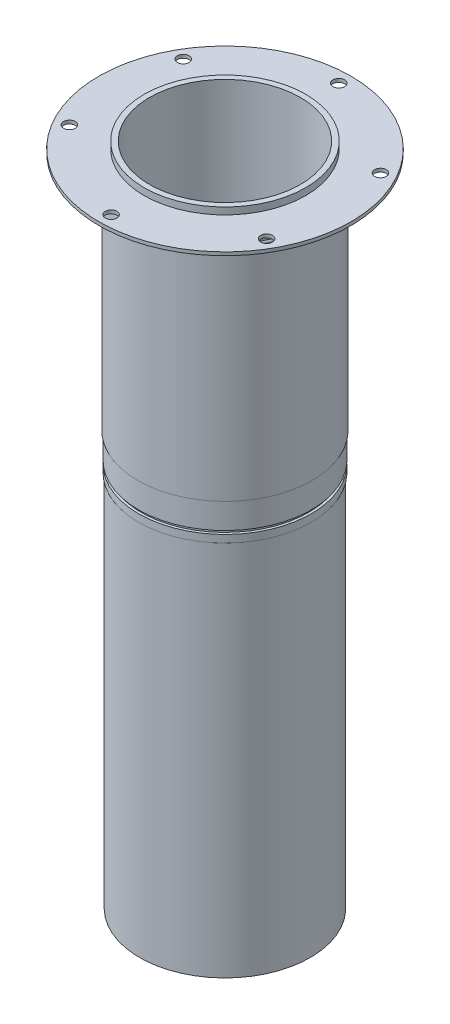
ISO-10303-21;
HEADER;
FILE_DESCRIPTION(('STEP AP214'),'2;1');
FILE_NAME('part.step','',(''),(''),'','','');
FILE_SCHEMA(('AUTOMOTIVE_DESIGN { 1 0 10303 214 1 1 1 1 }'));
ENDSEC;
DATA;
#1=APPLICATION_CONTEXT('core data for automotive mechanical design processes');
#2=APPLICATION_PROTOCOL_DEFINITION('international standard','automotive_design',2000,#1);
#3=PRODUCT_CONTEXT('',#1,'mechanical');
#4=PRODUCT('Part','Part','',(#3));
#5=PRODUCT_RELATED_PRODUCT_CATEGORY('part','',(#4));
#6=PRODUCT_DEFINITION_FORMATION('','',#4);
#7=PRODUCT_DEFINITION_CONTEXT('part definition',#1,'design');
#8=PRODUCT_DEFINITION('design','',#6,#7);
#9=PRODUCT_DEFINITION_SHAPE('','',#8);
#10=(LENGTH_UNIT() NAMED_UNIT(*) SI_UNIT(.MILLI.,.METRE.));
#11=(NAMED_UNIT(*) PLANE_ANGLE_UNIT() SI_UNIT($,.RADIAN.));
#12=(NAMED_UNIT(*) SI_UNIT($,.STERADIAN.) SOLID_ANGLE_UNIT());
#13=UNCERTAINTY_MEASURE_WITH_UNIT(LENGTH_MEASURE(1.E-05),#10,'distance_accuracy_value','');
#14=(GEOMETRIC_REPRESENTATION_CONTEXT(3) GLOBAL_UNCERTAINTY_ASSIGNED_CONTEXT((#13)) GLOBAL_UNIT_ASSIGNED_CONTEXT((#10,
#11,#12)) REPRESENTATION_CONTEXT('',''));
#15=CARTESIAN_POINT('',(0.,0.,0.));
#16=DIRECTION('',(0.,0.,1.));
#17=DIRECTION('',(1.,0.,0.));
#18=AXIS2_PLACEMENT_3D('',#15,#16,#17);
#19=CARTESIAN_POINT('',(-23.8125,0.,0.));
#20=DIRECTION('',(0.,-1.,0.));
#21=DIRECTION('',(0.,0.,-1.));
#22=AXIS2_PLACEMENT_3D('',#19,#20,#21);
#23=PLANE('',#22);
#24=CARTESIAN_POINT('',(0.,0.,0.));
#25=DIRECTION('',(0.,-1.,0.));
#26=DIRECTION('',(0.,0.,-1.));
#27=AXIS2_PLACEMENT_3D('',#24,#25,#26);
#28=CIRCLE('',#27,23.8125);
#29=CARTESIAN_POINT('',(0.,0.,-23.8125));
#30=VERTEX_POINT('',#29);
#31=EDGE_CURVE('E111',#30,#30,#28,.T.);
#32=ORIENTED_EDGE('',*,*,#31,.T.);
#33=EDGE_LOOP('',(#32));
#34=FACE_BOUND('',#33,.T.);
#35=CARTESIAN_POINT('',(0.,0.,0.));
#36=DIRECTION('',(0.,-1.,0.));
#37=DIRECTION('',(0.,0.,-1.));
#38=AXIS2_PLACEMENT_3D('',#35,#36,#37);
#39=CIRCLE('',#38,37.1348);
#40=CARTESIAN_POINT('',(0.,0.,-37.1348));
#41=VERTEX_POINT('',#40);
#42=EDGE_CURVE('E115',#41,#41,#39,.T.);
#43=ORIENTED_EDGE('',*,*,#42,.F.);
#44=EDGE_LOOP('',(#43));
#45=FACE_BOUND('',#44,.T.);
#46=CARTESIAN_POINT('',(29.0360997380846,0.,16.7640000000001));
#47=DIRECTION('',(0.,1.,0.));
#48=DIRECTION('',(0.,0.,1.));
#49=AXIS2_PLACEMENT_3D('',#46,#47,#48);
#50=CIRCLE('',#49,1.7272);
#51=CARTESIAN_POINT('',(29.0360997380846,0.,18.4912000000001));
#52=VERTEX_POINT('',#51);
#53=EDGE_CURVE('E122',#52,#52,#50,.T.);
#54=ORIENTED_EDGE('',*,*,#53,.F.);
#55=EDGE_LOOP('',(#54));
#56=FACE_BOUND('',#55,.T.);
#57=CARTESIAN_POINT('',(-2.34187669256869E-13,0.,33.528));
#58=DIRECTION('',(0.,1.,0.));
#59=DIRECTION('',(0.,0.,1.));
#60=AXIS2_PLACEMENT_3D('',#57,#58,#59);
#61=CIRCLE('',#60,1.7272);
#62=CARTESIAN_POINT('',(-2.34187669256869E-13,0.,35.2552));
#63=VERTEX_POINT('',#62);
#64=EDGE_CURVE('E129',#63,#63,#61,.T.);
#65=ORIENTED_EDGE('',*,*,#64,.F.);
#66=EDGE_LOOP('',(#65));
#67=FACE_BOUND('',#66,.T.);
#68=CARTESIAN_POINT('',(-29.0360997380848,0.,16.7639999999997));
#69=DIRECTION('',(0.,1.,0.));
#70=DIRECTION('',(0.,0.,1.));
#71=AXIS2_PLACEMENT_3D('',#68,#69,#70);
#72=CIRCLE('',#71,1.7272);
#73=CARTESIAN_POINT('',(-29.0360997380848,0.,18.4911999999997));
#74=VERTEX_POINT('',#73);
#75=EDGE_CURVE('E135',#74,#74,#72,.T.);
#76=ORIENTED_EDGE('',*,*,#75,.F.);
#77=EDGE_LOOP('',(#76));
#78=FACE_BOUND('',#77,.T.);
#79=CARTESIAN_POINT('',(-29.0360997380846,0.,-16.7640000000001));
#80=DIRECTION('',(0.,1.,0.));
#81=DIRECTION('',(0.,0.,1.));
#82=AXIS2_PLACEMENT_3D('',#79,#80,#81);
#83=CIRCLE('',#82,1.7272);
#84=CARTESIAN_POINT('',(-29.0360997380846,0.,-15.0368000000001));
#85=VERTEX_POINT('',#84);
#86=EDGE_CURVE('E142',#85,#85,#83,.T.);
#87=ORIENTED_EDGE('',*,*,#86,.F.);
#88=EDGE_LOOP('',(#87));
#89=FACE_BOUND('',#88,.T.);
#90=CARTESIAN_POINT('',(4.70110061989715E-13,0.,-33.528));
#91=DIRECTION('',(0.,1.,0.));
#92=DIRECTION('',(0.,0.,1.));
#93=AXIS2_PLACEMENT_3D('',#90,#91,#92);
#94=CIRCLE('',#93,1.7272);
#95=CARTESIAN_POINT('',(4.70110061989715E-13,0.,-31.8008));
#96=VERTEX_POINT('',#95);
#97=EDGE_CURVE('E150',#96,#96,#94,.T.);
#98=ORIENTED_EDGE('',*,*,#97,.F.);
#99=EDGE_LOOP('',(#98));
#100=FACE_BOUND('',#99,.T.);
#101=CARTESIAN_POINT('',(29.0360997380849,0.,-16.7639999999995));
#102=DIRECTION('',(0.,1.,0.));
#103=DIRECTION('',(0.,0.,1.));
#104=AXIS2_PLACEMENT_3D('',#101,#102,#103);
#105=CIRCLE('',#104,1.7272);
#106=CARTESIAN_POINT('',(29.0360997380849,0.,-15.0367999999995));
#107=VERTEX_POINT('',#106);
#108=EDGE_CURVE('E157',#107,#107,#105,.T.);
#109=ORIENTED_EDGE('',*,*,#108,.F.);
#110=EDGE_LOOP('',(#109));
#111=FACE_BOUND('',#110,.T.);
#112=ADVANCED_FACE('F37',(#34,#45,#56,#67,#78,#89,#100,#111),#23,.F.);
#113=CARTESIAN_POINT('',(0.,0.,0.));
#114=DIRECTION('',(0.,-1.,0.));
#115=DIRECTION('',(0.,0.,-1.));
#116=AXIS2_PLACEMENT_3D('',#113,#114,#115);
#117=CYLINDRICAL_SURFACE('',#116,37.1348);
#118=CARTESIAN_POINT('',(0.,-0.990600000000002,0.));
#119=DIRECTION('',(0.,-1.,0.));
#120=DIRECTION('',(0.,0.,-1.));
#121=AXIS2_PLACEMENT_3D('',#118,#119,#120);
#122=CIRCLE('',#121,37.1348);
#123=CARTESIAN_POINT('',(0.,-0.990600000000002,-37.1348));
#124=VERTEX_POINT('',#123);
#125=EDGE_CURVE('E45',#124,#124,#122,.T.);
#126=ORIENTED_EDGE('',*,*,#125,.F.);
#127=EDGE_LOOP('',(#126));
#128=FACE_BOUND('',#127,.T.);
#129=ORIENTED_EDGE('',*,*,#42,.T.);
#130=EDGE_LOOP('',(#129));
#131=FACE_BOUND('',#130,.T.);
#132=ADVANCED_FACE('F166',(#128,#131),#117,.T.);
#133=CARTESIAN_POINT('',(-37.1348,-0.990600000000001,0.));
#134=DIRECTION('',(0.,1.,0.));
#135=DIRECTION('',(0.,0.,1.));
#136=AXIS2_PLACEMENT_3D('',#133,#134,#135);
#137=PLANE('',#136);
#138=CARTESIAN_POINT('',(29.0360997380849,-0.990600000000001,-16.7639999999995));
#139=DIRECTION('',(0.,1.,0.));
#140=DIRECTION('',(0.,0.,1.));
#141=AXIS2_PLACEMENT_3D('',#138,#139,#140);
#142=CIRCLE('',#141,1.7272);
#143=CARTESIAN_POINT('',(29.0360997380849,-0.990600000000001,-15.0367999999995));
#144=VERTEX_POINT('',#143);
#145=EDGE_CURVE('E153',#144,#144,#142,.T.);
#146=ORIENTED_EDGE('',*,*,#145,.T.);
#147=EDGE_LOOP('',(#146));
#148=FACE_BOUND('',#147,.T.);
#149=CARTESIAN_POINT('',(4.70110061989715E-13,-0.990600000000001,-33.528));
#150=DIRECTION('',(0.,1.,0.));
#151=DIRECTION('',(0.,0.,1.));
#152=AXIS2_PLACEMENT_3D('',#149,#150,#151);
#153=CIRCLE('',#152,1.7272);
#154=CARTESIAN_POINT('',(4.70110061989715E-13,-0.990600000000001,-31.8008));
#155=VERTEX_POINT('',#154);
#156=EDGE_CURVE('E146',#155,#155,#153,.T.);
#157=ORIENTED_EDGE('',*,*,#156,.T.);
#158=EDGE_LOOP('',(#157));
#159=FACE_BOUND('',#158,.T.);
#160=CARTESIAN_POINT('',(-29.0360997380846,-0.990600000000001,-16.7640000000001));
#161=DIRECTION('',(0.,1.,0.));
#162=DIRECTION('',(0.,0.,1.));
#163=AXIS2_PLACEMENT_3D('',#160,#161,#162);
#164=CIRCLE('',#163,1.7272);
#165=CARTESIAN_POINT('',(-29.0360997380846,-0.990600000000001,-15.0368000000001));
#166=VERTEX_POINT('',#165);
#167=EDGE_CURVE('E138',#166,#166,#164,.T.);
#168=ORIENTED_EDGE('',*,*,#167,.T.);
#169=EDGE_LOOP('',(#168));
#170=FACE_BOUND('',#169,.T.);
#171=CARTESIAN_POINT('',(-29.0360997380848,-0.990600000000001,16.7639999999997));
#172=DIRECTION('',(0.,1.,0.));
#173=DIRECTION('',(0.,0.,1.));
#174=AXIS2_PLACEMENT_3D('',#171,#172,#173);
#175=CIRCLE('',#174,1.7272);
#176=CARTESIAN_POINT('',(-29.0360997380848,-0.990600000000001,18.4911999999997));
#177=VERTEX_POINT('',#176);
#178=EDGE_CURVE('E132',#177,#177,#175,.T.);
#179=ORIENTED_EDGE('',*,*,#178,.T.);
#180=EDGE_LOOP('',(#179));
#181=FACE_BOUND('',#180,.T.);
#182=CARTESIAN_POINT('',(-2.34187669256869E-13,-0.990600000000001,33.528));
#183=DIRECTION('',(0.,1.,0.));
#184=DIRECTION('',(0.,0.,1.));
#185=AXIS2_PLACEMENT_3D('',#182,#183,#184);
#186=CIRCLE('',#185,1.7272);
#187=CARTESIAN_POINT('',(-2.34187669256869E-13,-0.990600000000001,35.2552));
#188=VERTEX_POINT('',#187);
#189=EDGE_CURVE('E126',#188,#188,#186,.T.);
#190=ORIENTED_EDGE('',*,*,#189,.T.);
#191=EDGE_LOOP('',(#190));
#192=FACE_BOUND('',#191,.T.);
#193=CARTESIAN_POINT('',(29.0360997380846,-0.990600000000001,16.7640000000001));
#194=DIRECTION('',(0.,1.,0.));
#195=DIRECTION('',(0.,0.,1.));
#196=AXIS2_PLACEMENT_3D('',#193,#194,#195);
#197=CIRCLE('',#196,1.7272);
#198=CARTESIAN_POINT('',(29.0360997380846,-0.990600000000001,18.4912000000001));
#199=VERTEX_POINT('',#198);
#200=EDGE_CURVE('E118',#199,#199,#197,.T.);
#201=ORIENTED_EDGE('',*,*,#200,.T.);
#202=EDGE_LOOP('',(#201));
#203=FACE_BOUND('',#202,.T.);
#204=CARTESIAN_POINT('',(0.,-0.9906,0.));
#205=DIRECTION('',(0.,-1.,0.));
#206=DIRECTION('',(0.,0.,-1.));
#207=AXIS2_PLACEMENT_3D('',#204,#205,#206);
#208=CIRCLE('',#207,25.4);
#209=CARTESIAN_POINT('',(0.,-0.9906,-25.4));
#210=VERTEX_POINT('',#209);
#211=EDGE_CURVE('E52',#210,#210,#208,.T.);
#212=ORIENTED_EDGE('',*,*,#211,.F.);
#213=EDGE_LOOP('',(#212));
#214=FACE_BOUND('',#213,.T.);
#215=ORIENTED_EDGE('',*,*,#125,.T.);
#216=EDGE_LOOP('',(#215));
#217=FACE_BOUND('',#216,.T.);
#218=ADVANCED_FACE('F172',(#148,#159,#170,#181,#192,#203,#214,#217),#137,.F.);
#219=CARTESIAN_POINT('',(0.,0.,0.));
#220=DIRECTION('',(0.,-1.,0.));
#221=DIRECTION('',(0.,0.,-1.));
#222=AXIS2_PLACEMENT_3D('',#219,#220,#221);
#223=CYLINDRICAL_SURFACE('',#222,25.4);
#224=CARTESIAN_POINT('',(0.,-6.35,0.));
#225=DIRECTION('',(0.,-1.,0.));
#226=DIRECTION('',(0.,0.,-1.));
#227=AXIS2_PLACEMENT_3D('',#224,#225,#226);
#228=CIRCLE('',#227,25.4);
#229=CARTESIAN_POINT('',(0.,-6.35,-25.4));
#230=VERTEX_POINT('',#229);
#231=EDGE_CURVE('E59',#230,#230,#228,.T.);
#232=ORIENTED_EDGE('',*,*,#231,.F.);
#233=EDGE_LOOP('',(#232));
#234=FACE_BOUND('',#233,.T.);
#235=ORIENTED_EDGE('',*,*,#211,.T.);
#236=EDGE_LOOP('',(#235));
#237=FACE_BOUND('',#236,.T.);
#238=ADVANCED_FACE('F230',(#234,#237),#223,.T.);
#239=CARTESIAN_POINT('',(0.,0.,0.));
#240=DIRECTION('',(0.,-1.,0.));
#241=DIRECTION('',(0.,0.,-1.));
#242=AXIS2_PLACEMENT_3D('',#239,#240,#241);
#243=CYLINDRICAL_SURFACE('',#242,25.654);
#244=CARTESIAN_POINT('',(0.,-6.91796126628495,0.));
#245=DIRECTION('',(0.,1.,0.));
#246=DIRECTION('',(0.,0.,1.));
#247=AXIS2_PLACEMENT_3D('',#244,#245,#246);
#248=CIRCLE('',#247,25.654);
#249=CARTESIAN_POINT('',(0.,-6.91796126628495,25.654));
#250=VERTEX_POINT('',#249);
#251=EDGE_CURVE('E10',#250,#250,#248,.F.);
#252=ORIENTED_EDGE('',*,*,#251,.T.);
#253=EDGE_LOOP('',(#252));
#254=FACE_BOUND('',#253,.T.);
#255=CARTESIAN_POINT('',(0.,-71.755,0.));
#256=DIRECTION('',(0.,-1.,0.));
#257=DIRECTION('',(0.,0.,-1.));
#258=AXIS2_PLACEMENT_3D('',#255,#256,#257);
#259=CIRCLE('',#258,25.654);
#260=CARTESIAN_POINT('',(0.,-71.755,-25.654));
#261=VERTEX_POINT('',#260);
#262=EDGE_CURVE('E64',#261,#261,#259,.T.);
#263=ORIENTED_EDGE('',*,*,#262,.F.);
#264=EDGE_LOOP('',(#263));
#265=FACE_BOUND('',#264,.T.);
#266=ADVANCED_FACE('F226',(#254,#265),#243,.T.);
#267=CARTESIAN_POINT('',(-25.4,-71.755,0.));
#268=DIRECTION('',(0.,1.,0.));
#269=DIRECTION('',(0.,0.,1.));
#270=AXIS2_PLACEMENT_3D('',#267,#268,#269);
#271=PLANE('',#270);
#272=CARTESIAN_POINT('',(0.,-71.755,0.));
#273=DIRECTION('',(0.,-1.,0.));
#274=DIRECTION('',(0.,0.,-1.));
#275=AXIS2_PLACEMENT_3D('',#272,#273,#274);
#276=CIRCLE('',#275,25.4);
#277=CARTESIAN_POINT('',(0.,-71.755,-25.4));
#278=VERTEX_POINT('',#277);
#279=EDGE_CURVE('E68',#278,#278,#276,.T.);
#280=ORIENTED_EDGE('',*,*,#279,.F.);
#281=EDGE_LOOP('',(#280));
#282=FACE_BOUND('',#281,.T.);
#283=ORIENTED_EDGE('',*,*,#262,.T.);
#284=EDGE_LOOP('',(#283));
#285=FACE_BOUND('',#284,.T.);
#286=ADVANCED_FACE('F222',(#282,#285),#271,.F.);
#287=CARTESIAN_POINT('',(0.,0.,0.));
#288=DIRECTION('',(0.,-1.,0.));
#289=DIRECTION('',(0.,0.,-1.));
#290=AXIS2_PLACEMENT_3D('',#287,#288,#289);
#291=CYLINDRICAL_SURFACE('',#290,25.4);
#292=CARTESIAN_POINT('',(0.,-79.375,0.));
#293=DIRECTION('',(0.,-1.,0.));
#294=DIRECTION('',(0.,0.,-1.));
#295=AXIS2_PLACEMENT_3D('',#292,#293,#294);
#296=CIRCLE('',#295,25.4);
#297=CARTESIAN_POINT('',(0.,-79.375,-25.4));
#298=VERTEX_POINT('',#297);
#299=EDGE_CURVE('E72',#298,#298,#296,.T.);
#300=ORIENTED_EDGE('',*,*,#299,.F.);
#301=EDGE_LOOP('',(#300));
#302=FACE_BOUND('',#301,.T.);
#303=ORIENTED_EDGE('',*,*,#279,.T.);
#304=EDGE_LOOP('',(#303));
#305=FACE_BOUND('',#304,.T.);
#306=ADVANCED_FACE('F218',(#302,#305),#291,.T.);
#307=CARTESIAN_POINT('',(-24.6761,-79.375,0.));
#308=DIRECTION('',(0.,1.,0.));
#309=DIRECTION('',(0.,0.,1.));
#310=AXIS2_PLACEMENT_3D('',#307,#308,#309);
#311=PLANE('',#310);
#312=CARTESIAN_POINT('',(0.,-79.375,0.));
#313=DIRECTION('',(0.,-1.,0.));
#314=DIRECTION('',(0.,0.,-1.));
#315=AXIS2_PLACEMENT_3D('',#312,#313,#314);
#316=CIRCLE('',#315,24.6761);
#317=CARTESIAN_POINT('',(0.,-79.375,-24.6761));
#318=VERTEX_POINT('',#317);
#319=EDGE_CURVE('E76',#318,#318,#316,.T.);
#320=ORIENTED_EDGE('',*,*,#319,.F.);
#321=EDGE_LOOP('',(#320));
#322=FACE_BOUND('',#321,.T.);
#323=ORIENTED_EDGE('',*,*,#299,.T.);
#324=EDGE_LOOP('',(#323));
#325=FACE_BOUND('',#324,.T.);
#326=ADVANCED_FACE('F214',(#322,#325),#311,.F.);
#327=CARTESIAN_POINT('',(0.,0.,0.));
#328=DIRECTION('',(0.,-1.,0.));
#329=DIRECTION('',(0.,0.,-1.));
#330=AXIS2_PLACEMENT_3D('',#327,#328,#329);
#331=CYLINDRICAL_SURFACE('',#330,24.6761);
#332=CARTESIAN_POINT('',(0.,-80.3656,0.));
#333=DIRECTION('',(0.,-1.,0.));
#334=DIRECTION('',(0.,0.,-1.));
#335=AXIS2_PLACEMENT_3D('',#332,#333,#334);
#336=CIRCLE('',#335,24.6761);
#337=CARTESIAN_POINT('',(0.,-80.3656,-24.6761));
#338=VERTEX_POINT('',#337);
#339=EDGE_CURVE('E80',#338,#338,#336,.T.);
#340=ORIENTED_EDGE('',*,*,#339,.F.);
#341=EDGE_LOOP('',(#340));
#342=FACE_BOUND('',#341,.T.);
#343=ORIENTED_EDGE('',*,*,#319,.T.);
#344=EDGE_LOOP('',(#343));
#345=FACE_BOUND('',#344,.T.);
#346=ADVANCED_FACE('F210',(#342,#345),#331,.T.);
#347=CARTESIAN_POINT('',(-25.4,-80.3656,0.));
#348=DIRECTION('',(0.,-1.,0.));
#349=DIRECTION('',(0.,0.,-1.));
#350=AXIS2_PLACEMENT_3D('',#347,#348,#349);
#351=PLANE('',#350);
#352=CARTESIAN_POINT('',(0.,-80.3656,0.));
#353=DIRECTION('',(0.,-1.,0.));
#354=DIRECTION('',(0.,0.,-1.));
#355=AXIS2_PLACEMENT_3D('',#352,#353,#354);
#356=CIRCLE('',#355,25.4);
#357=CARTESIAN_POINT('',(0.,-80.3656,-25.4));
#358=VERTEX_POINT('',#357);
#359=EDGE_CURVE('E84',#358,#358,#356,.T.);
#360=ORIENTED_EDGE('',*,*,#359,.F.);
#361=EDGE_LOOP('',(#360));
#362=FACE_BOUND('',#361,.T.);
#363=ORIENTED_EDGE('',*,*,#339,.T.);
#364=EDGE_LOOP('',(#363));
#365=FACE_BOUND('',#364,.T.);
#366=ADVANCED_FACE('F206',(#362,#365),#351,.F.);
#367=CARTESIAN_POINT('',(0.,0.,0.));
#368=DIRECTION('',(0.,-1.,0.));
#369=DIRECTION('',(0.,0.,-1.));
#370=AXIS2_PLACEMENT_3D('',#367,#368,#369);
#371=CYLINDRICAL_SURFACE('',#370,25.4);
#372=CARTESIAN_POINT('',(0.,-82.55,0.));
#373=DIRECTION('',(0.,-1.,0.));
#374=DIRECTION('',(0.,0.,-1.));
#375=AXIS2_PLACEMENT_3D('',#372,#373,#374);
#376=CIRCLE('',#375,25.4);
#377=CARTESIAN_POINT('',(0.,-82.55,-25.4));
#378=VERTEX_POINT('',#377);
#379=EDGE_CURVE('E88',#378,#378,#376,.T.);
#380=ORIENTED_EDGE('',*,*,#379,.F.);
#381=EDGE_LOOP('',(#380));
#382=FACE_BOUND('',#381,.T.);
#383=ORIENTED_EDGE('',*,*,#359,.T.);
#384=EDGE_LOOP('',(#383));
#385=FACE_BOUND('',#384,.T.);
#386=ADVANCED_FACE('F202',(#382,#385),#371,.T.);
#387=CARTESIAN_POINT('',(-25.146,-82.55,0.));
#388=DIRECTION('',(0.,1.,0.));
#389=DIRECTION('',(0.,0.,1.));
#390=AXIS2_PLACEMENT_3D('',#387,#388,#389);
#391=PLANE('',#390);
#392=CARTESIAN_POINT('',(0.,-82.55,0.));
#393=DIRECTION('',(0.,-1.,0.));
#394=DIRECTION('',(0.,0.,-1.));
#395=AXIS2_PLACEMENT_3D('',#392,#393,#394);
#396=CIRCLE('',#395,25.146);
#397=CARTESIAN_POINT('',(0.,-82.55,-25.146));
#398=VERTEX_POINT('',#397);
#399=EDGE_CURVE('E92',#398,#398,#396,.T.);
#400=ORIENTED_EDGE('',*,*,#399,.F.);
#401=EDGE_LOOP('',(#400));
#402=FACE_BOUND('',#401,.T.);
#403=ORIENTED_EDGE('',*,*,#379,.T.);
#404=EDGE_LOOP('',(#403));
#405=FACE_BOUND('',#404,.T.);
#406=ADVANCED_FACE('F198',(#402,#405),#391,.F.);
#407=CARTESIAN_POINT('',(0.,0.,0.));
#408=DIRECTION('',(0.,-1.,0.));
#409=DIRECTION('',(0.,0.,-1.));
#410=AXIS2_PLACEMENT_3D('',#407,#408,#409);
#411=CYLINDRICAL_SURFACE('',#410,25.146);
#412=CARTESIAN_POINT('',(0.,-193.675,0.));
#413=DIRECTION('',(0.,-1.,0.));
#414=DIRECTION('',(0.,0.,-1.));
#415=AXIS2_PLACEMENT_3D('',#412,#413,#414);
#416=CIRCLE('',#415,25.146);
#417=CARTESIAN_POINT('',(0.,-193.675,-25.146));
#418=VERTEX_POINT('',#417);
#419=EDGE_CURVE('E96',#418,#418,#416,.T.);
#420=ORIENTED_EDGE('',*,*,#419,.F.);
#421=EDGE_LOOP('',(#420));
#422=FACE_BOUND('',#421,.T.);
#423=ORIENTED_EDGE('',*,*,#399,.T.);
#424=EDGE_LOOP('',(#423));
#425=FACE_BOUND('',#424,.T.);
#426=ADVANCED_FACE('F194',(#422,#425),#411,.T.);
#427=CARTESIAN_POINT('',(-22.225,-193.675,0.));
#428=DIRECTION('',(0.,1.,0.));
#429=DIRECTION('',(0.,0.,1.));
#430=AXIS2_PLACEMENT_3D('',#427,#428,#429);
#431=PLANE('',#430);
#432=CARTESIAN_POINT('',(0.,-193.675,0.));
#433=DIRECTION('',(0.,-1.,0.));
#434=DIRECTION('',(0.,0.,-1.));
#435=AXIS2_PLACEMENT_3D('',#432,#433,#434);
#436=CIRCLE('',#435,22.225);
#437=CARTESIAN_POINT('',(0.,-193.675,-22.225));
#438=VERTEX_POINT('',#437);
#439=EDGE_CURVE('E100',#438,#438,#436,.T.);
#440=ORIENTED_EDGE('',*,*,#439,.F.);
#441=EDGE_LOOP('',(#440));
#442=FACE_BOUND('',#441,.T.);
#443=ORIENTED_EDGE('',*,*,#419,.T.);
#444=EDGE_LOOP('',(#443));
#445=FACE_BOUND('',#444,.T.);
#446=ADVANCED_FACE('F190',(#442,#445),#431,.F.);
#447=CARTESIAN_POINT('',(0.,0.,0.));
#448=DIRECTION('',(0.,-1.,0.));
#449=DIRECTION('',(0.,0.,-1.));
#450=AXIS2_PLACEMENT_3D('',#447,#448,#449);
#451=CYLINDRICAL_SURFACE('',#450,22.225);
#452=CARTESIAN_POINT('',(0.,2.032,0.));
#453=DIRECTION('',(0.,-1.,0.));
#454=DIRECTION('',(0.,0.,-1.));
#455=AXIS2_PLACEMENT_3D('',#452,#453,#454);
#456=CIRCLE('',#455,22.225);
#457=CARTESIAN_POINT('',(0.,2.032,-22.225));
#458=VERTEX_POINT('',#457);
#459=EDGE_CURVE('E104',#458,#458,#456,.T.);
#460=ORIENTED_EDGE('',*,*,#459,.F.);
#461=EDGE_LOOP('',(#460));
#462=FACE_BOUND('',#461,.T.);
#463=ORIENTED_EDGE('',*,*,#439,.T.);
#464=EDGE_LOOP('',(#463));
#465=FACE_BOUND('',#464,.T.);
#466=ADVANCED_FACE('F186',(#462,#465),#451,.F.);
#467=CARTESIAN_POINT('',(-23.8125,2.032,0.));
#468=DIRECTION('',(0.,-1.,0.));
#469=DIRECTION('',(0.,0.,-1.));
#470=AXIS2_PLACEMENT_3D('',#467,#468,#469);
#471=PLANE('',#470);
#472=CARTESIAN_POINT('',(0.,2.032,0.));
#473=DIRECTION('',(0.,-1.,0.));
#474=DIRECTION('',(0.,0.,-1.));
#475=AXIS2_PLACEMENT_3D('',#472,#473,#474);
#476=CIRCLE('',#475,23.8125);
#477=CARTESIAN_POINT('',(0.,2.032,-23.8125));
#478=VERTEX_POINT('',#477);
#479=EDGE_CURVE('E108',#478,#478,#476,.T.);
#480=ORIENTED_EDGE('',*,*,#479,.F.);
#481=EDGE_LOOP('',(#480));
#482=FACE_BOUND('',#481,.T.);
#483=ORIENTED_EDGE('',*,*,#459,.T.);
#484=EDGE_LOOP('',(#483));
#485=FACE_BOUND('',#484,.T.);
#486=ADVANCED_FACE('F182',(#482,#485),#471,.F.);
#487=CARTESIAN_POINT('',(0.,0.,0.));
#488=DIRECTION('',(0.,-1.,0.));
#489=DIRECTION('',(0.,0.,-1.));
#490=AXIS2_PLACEMENT_3D('',#487,#488,#489);
#491=CYLINDRICAL_SURFACE('',#490,23.8125);
#492=ORIENTED_EDGE('',*,*,#31,.F.);
#493=EDGE_LOOP('',(#492));
#494=FACE_BOUND('',#493,.T.);
#495=ORIENTED_EDGE('',*,*,#479,.T.);
#496=EDGE_LOOP('',(#495));
#497=FACE_BOUND('',#496,.T.);
#498=ADVANCED_FACE('F179',(#494,#497),#491,.T.);
#499=CARTESIAN_POINT('',(29.0360997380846,0.,16.7640000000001));
#500=DIRECTION('',(0.,1.,0.));
#501=DIRECTION('',(0.,0.,1.));
#502=AXIS2_PLACEMENT_3D('',#499,#500,#501);
#503=CYLINDRICAL_SURFACE('',#502,1.7272);
#504=ORIENTED_EDGE('',*,*,#53,.T.);
#505=EDGE_LOOP('',(#504));
#506=FACE_BOUND('',#505,.T.);
#507=ORIENTED_EDGE('',*,*,#200,.F.);
#508=EDGE_LOOP('',(#507));
#509=FACE_BOUND('',#508,.T.);
#510=ADVANCED_FACE('F177',(#506,#509),#503,.F.);
#511=CARTESIAN_POINT('',(0.,-6.91796126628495,0.));
#512=DIRECTION('',(0.,1.,0.));
#513=DIRECTION('',(0.,0.,1.));
#514=AXIS2_PLACEMENT_3D('',#511,#512,#513);
#515=TOROIDAL_SURFACE('',#514,24.892,0.762);
#516=ORIENTED_EDGE('',*,*,#231,.T.);
#517=EDGE_LOOP('',(#516));
#518=FACE_BOUND('',#517,.T.);
#519=ORIENTED_EDGE('',*,*,#251,.F.);
#520=EDGE_LOOP('',(#519));
#521=FACE_BOUND('',#520,.T.);
#522=ADVANCED_FACE('F39',(#518,#521),#515,.T.);
#523=CARTESIAN_POINT('',(-2.34187669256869E-13,0.,33.528));
#524=DIRECTION('',(0.,1.,0.));
#525=DIRECTION('',(0.,0.,1.));
#526=AXIS2_PLACEMENT_3D('',#523,#524,#525);
#527=CYLINDRICAL_SURFACE('',#526,1.7272);
#528=ORIENTED_EDGE('',*,*,#64,.T.);
#529=EDGE_LOOP('',(#528));
#530=FACE_BOUND('',#529,.T.);
#531=ORIENTED_EDGE('',*,*,#189,.F.);
#532=EDGE_LOOP('',(#531));
#533=FACE_BOUND('',#532,.T.);
#534=ADVANCED_FACE('F258',(#530,#533),#527,.F.);
#535=CARTESIAN_POINT('',(-29.0360997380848,0.,16.7639999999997));
#536=DIRECTION('',(0.,1.,0.));
#537=DIRECTION('',(0.,0.,1.));
#538=AXIS2_PLACEMENT_3D('',#535,#536,#537);
#539=CYLINDRICAL_SURFACE('',#538,1.7272);
#540=ORIENTED_EDGE('',*,*,#75,.T.);
#541=EDGE_LOOP('',(#540));
#542=FACE_BOUND('',#541,.T.);
#543=ORIENTED_EDGE('',*,*,#178,.F.);
#544=EDGE_LOOP('',(#543));
#545=FACE_BOUND('',#544,.T.);
#546=ADVANCED_FACE('F281',(#542,#545),#539,.F.);
#547=CARTESIAN_POINT('',(-29.0360997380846,0.,-16.7640000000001));
#548=DIRECTION('',(0.,1.,0.));
#549=DIRECTION('',(0.,0.,1.));
#550=AXIS2_PLACEMENT_3D('',#547,#548,#549);
#551=CYLINDRICAL_SURFACE('',#550,1.7272);
#552=ORIENTED_EDGE('',*,*,#86,.T.);
#553=EDGE_LOOP('',(#552));
#554=FACE_BOUND('',#553,.T.);
#555=ORIENTED_EDGE('',*,*,#167,.F.);
#556=EDGE_LOOP('',(#555));
#557=FACE_BOUND('',#556,.T.);
#558=ADVANCED_FACE('F274',(#554,#557),#551,.F.);
#559=CARTESIAN_POINT('',(4.70110061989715E-13,0.,-33.528));
#560=DIRECTION('',(0.,1.,0.));
#561=DIRECTION('',(0.,0.,1.));
#562=AXIS2_PLACEMENT_3D('',#559,#560,#561);
#563=CYLINDRICAL_SURFACE('',#562,1.7272);
#564=ORIENTED_EDGE('',*,*,#97,.T.);
#565=EDGE_LOOP('',(#564));
#566=FACE_BOUND('',#565,.T.);
#567=ORIENTED_EDGE('',*,*,#156,.F.);
#568=EDGE_LOOP('',(#567));
#569=FACE_BOUND('',#568,.T.);
#570=ADVANCED_FACE('F271',(#566,#569),#563,.F.);
#571=CARTESIAN_POINT('',(29.0360997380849,0.,-16.7639999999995));
#572=DIRECTION('',(0.,1.,0.));
#573=DIRECTION('',(0.,0.,1.));
#574=AXIS2_PLACEMENT_3D('',#571,#572,#573);
#575=CYLINDRICAL_SURFACE('',#574,1.7272);
#576=ORIENTED_EDGE('',*,*,#108,.T.);
#577=EDGE_LOOP('',(#576));
#578=FACE_BOUND('',#577,.T.);
#579=ORIENTED_EDGE('',*,*,#145,.F.);
#580=EDGE_LOOP('',(#579));
#581=FACE_BOUND('',#580,.T.);
#582=ADVANCED_FACE('F162',(#578,#581),#575,.F.);
#583=CLOSED_SHELL('',(#112,#132,#218,#238,#266,#286,#306,#326,#346,#366,#386,#406,#426,#446,
#466,#486,#498,#510,#522,#534,#546,#558,#570,#582));
#584=MANIFOLD_SOLID_BREP('B2',#583);
#585=ADVANCED_BREP_SHAPE_REPRESENTATION('',(#18,#584),#14);
#586=SHAPE_DEFINITION_REPRESENTATION(#9,#585);
ENDSEC;
END-ISO-10303-21;
